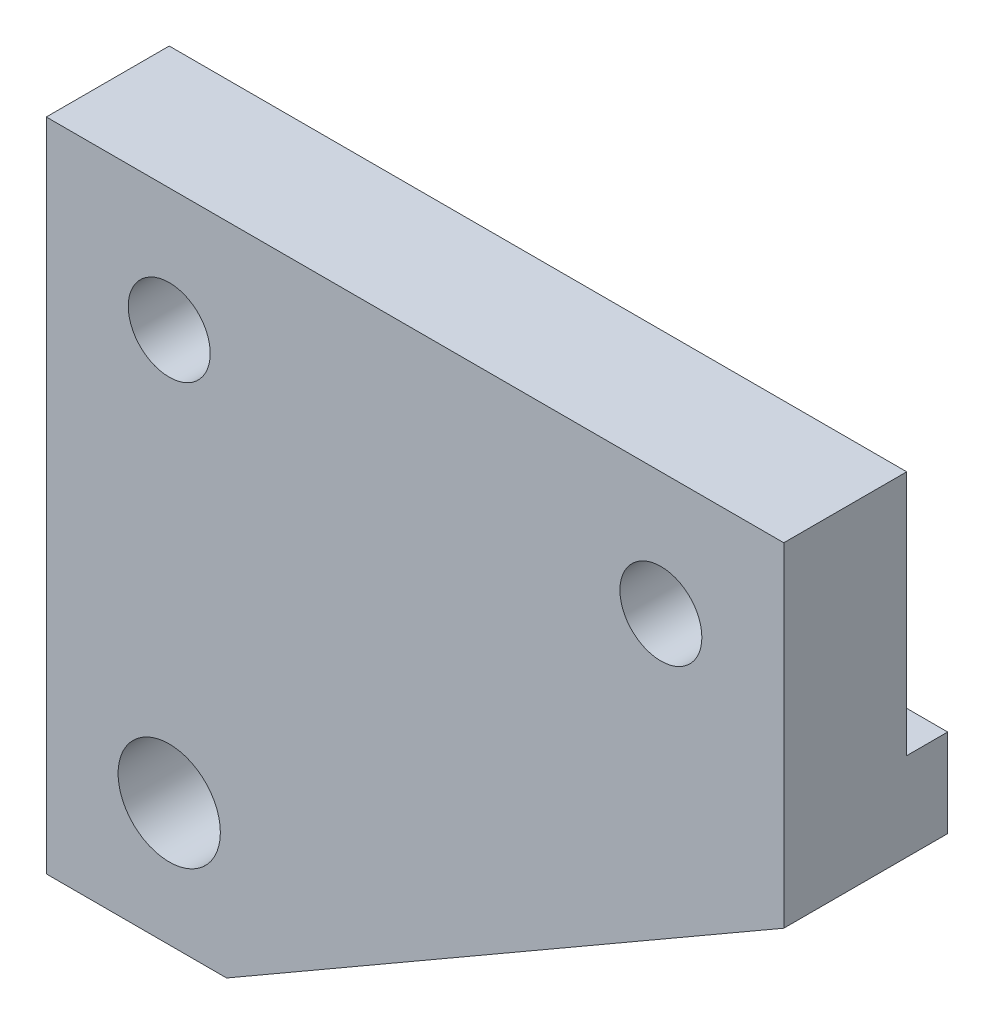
from build123d import *

# Parameters (mm, degrees)
SKETCH2_R           = 3.175
SKETCH2_R_2         = 3.9624
BOSS_EXTRUDE1_DEPTH = 12.7
CUT_EXTRUDE2_DEPTH  = 3.175
CHAMFER1_SIZE       = 43.18
CHAMFER1_SIZE2      = 24.929984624


with BuildPart() as part:
    # Sketch2 → Boss-Extrude1 (new body)
    with BuildSketch(Plane.XY):
        Polygon((28.575, -50.8), (-28.575, -50.8), (-28.575, 0), (0, 0), (28.575, 0), align=None)
        with Locations((-19.05, -9.525)):
            Circle(SKETCH2_R, mode=Mode.SUBTRACT)
        with Locations((19.05, -9.525)):
            Circle(SKETCH2_R, mode=Mode.SUBTRACT)
        with Locations((-19.05, -41.275)):
            Circle(SKETCH2_R_2, mode=Mode.SUBTRACT)
    extrude(amount=BOSS_EXTRUDE1_DEPTH)

    # Sketch4 → Cut-Extrude2 (cut)
    with BuildSketch(Plane.XY):
        Polygon((-28.575, -19.05), (28.575, -19.05), (28.575, 0), (0, 0), (-28.575, 0), align=None)
    extrude(amount=CUT_EXTRUDE2_DEPTH, mode=Mode.SUBTRACT)

    # Chamfer1
    chamfer1_edges = [part.edges().sort_by_distance(p)[0] for p in [
        (28.575, -50.8, 6.35),
    ]]
    chamfer1_side = [part.faces().sort_by_distance(p)[0] for p in [
        (0, -50.8, 6.35),
    ]]
    chamfer(chamfer1_edges, length=CHAMFER1_SIZE, length2=CHAMFER1_SIZE2, reference=chamfer1_side[0])


solid = part.part
